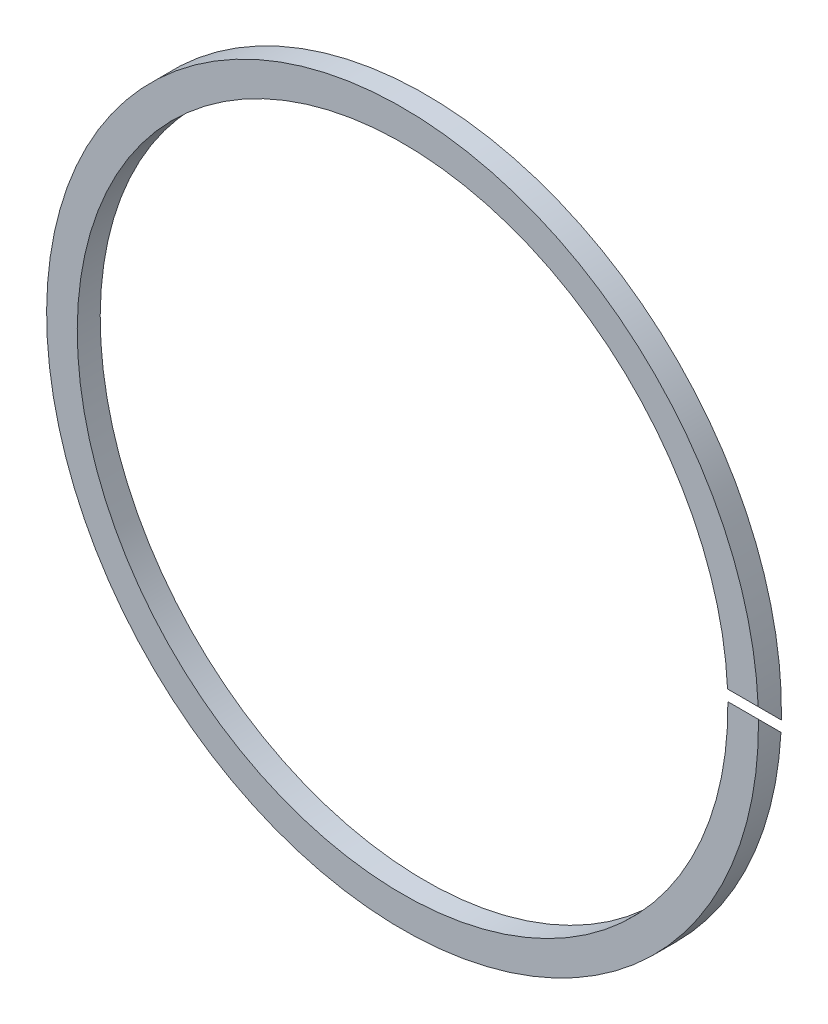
from build123d import *

# Parameters (mm, degrees)
SKETCH1_R           = 46.5
SKETCH1_R_2         = 42.5
BOSS_EXTRUDE1_DEPTH = 3
CUT_EXTRUDE1_DEPTH  = 6


with BuildPart() as part:
    # Sketch1 → Boss-Extrude1 (new body)
    with BuildSketch(Plane.XY):
        Circle(SKETCH1_R)
        Circle(SKETCH1_R_2, mode=Mode.SUBTRACT)
    extrude(amount=BOSS_EXTRUDE1_DEPTH)

    # Sketch2 → Cut-Extrude1 (cut)
    with BuildSketch(Plane(origin=(46.5, 0, 0), x_dir=(0, 0, -1), z_dir=(1, 0, 0))):
        Polygon((0, -1.048364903), (-3, 1.951635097), (-3, 0.537421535), (0, -2.462578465), align=None)
    extrude(amount=-CUT_EXTRUDE1_DEPTH, mode=Mode.SUBTRACT)


solid = part.part
